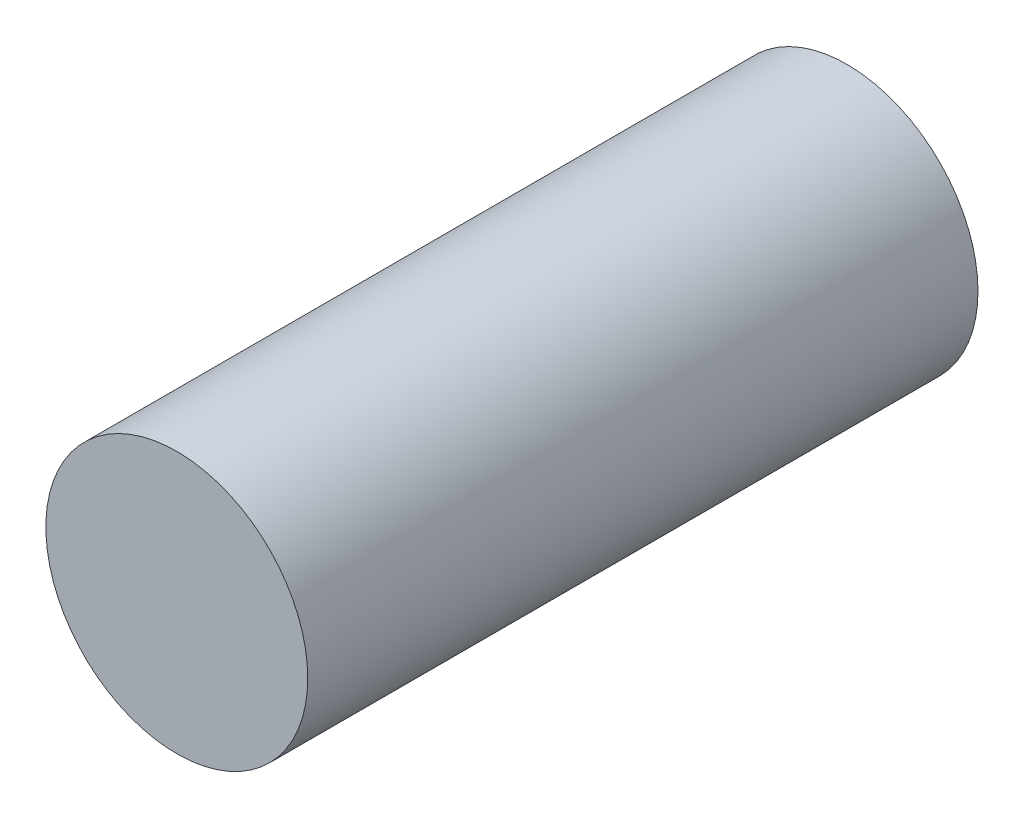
ISO-10303-21;
HEADER;
FILE_DESCRIPTION(('STEP AP214'),'2;1');
FILE_NAME('part.step','',(''),(''),'','','');
FILE_SCHEMA(('AUTOMOTIVE_DESIGN { 1 0 10303 214 1 1 1 1 }'));
ENDSEC;
DATA;
#1=APPLICATION_CONTEXT('core data for automotive mechanical design processes');
#2=APPLICATION_PROTOCOL_DEFINITION('international standard','automotive_design',2000,#1);
#3=PRODUCT_CONTEXT('',#1,'mechanical');
#4=PRODUCT('Part','Part','',(#3));
#5=PRODUCT_RELATED_PRODUCT_CATEGORY('part','',(#4));
#6=PRODUCT_DEFINITION_FORMATION('','',#4);
#7=PRODUCT_DEFINITION_CONTEXT('part definition',#1,'design');
#8=PRODUCT_DEFINITION('design','',#6,#7);
#9=PRODUCT_DEFINITION_SHAPE('','',#8);
#10=(LENGTH_UNIT() NAMED_UNIT(*) SI_UNIT(.MILLI.,.METRE.));
#11=(NAMED_UNIT(*) PLANE_ANGLE_UNIT() SI_UNIT($,.RADIAN.));
#12=(NAMED_UNIT(*) SI_UNIT($,.STERADIAN.) SOLID_ANGLE_UNIT());
#13=UNCERTAINTY_MEASURE_WITH_UNIT(LENGTH_MEASURE(1.E-05),#10,'distance_accuracy_value','');
#14=(GEOMETRIC_REPRESENTATION_CONTEXT(3) GLOBAL_UNCERTAINTY_ASSIGNED_CONTEXT((#13)) GLOBAL_UNIT_ASSIGNED_CONTEXT((#10,
#11,#12)) REPRESENTATION_CONTEXT('',''));
#15=CARTESIAN_POINT('',(0.,0.,0.));
#16=DIRECTION('',(0.,0.,1.));
#17=DIRECTION('',(1.,0.,0.));
#18=AXIS2_PLACEMENT_3D('',#15,#16,#17);
#19=CARTESIAN_POINT('',(0.,0.,65.));
#20=DIRECTION('',(0.,0.,-1.));
#21=DIRECTION('',(-1.,0.,0.));
#22=AXIS2_PLACEMENT_3D('',#19,#20,#21);
#23=CYLINDRICAL_SURFACE('',#22,12.7);
#24=CARTESIAN_POINT('',(0.,0.,65.));
#25=DIRECTION('',(0.,0.,1.));
#26=DIRECTION('',(1.,0.,0.));
#27=AXIS2_PLACEMENT_3D('',#24,#25,#26);
#28=CIRCLE('',#27,12.7);
#29=CARTESIAN_POINT('',(12.7,0.,65.));
#30=VERTEX_POINT('',#29);
#31=EDGE_CURVE('E10',#30,#30,#28,.T.);
#32=ORIENTED_EDGE('',*,*,#31,.F.);
#33=EDGE_LOOP('',(#32));
#34=FACE_BOUND('',#33,.T.);
#35=CARTESIAN_POINT('',(0.,0.,0.));
#36=DIRECTION('',(0.,0.,1.));
#37=DIRECTION('',(1.,0.,0.));
#38=AXIS2_PLACEMENT_3D('',#35,#36,#37);
#39=CIRCLE('',#38,12.7);
#40=CARTESIAN_POINT('',(12.7,0.,0.));
#41=VERTEX_POINT('',#40);
#42=EDGE_CURVE('E34',#41,#41,#39,.T.);
#43=ORIENTED_EDGE('',*,*,#42,.T.);
#44=EDGE_LOOP('',(#43));
#45=FACE_BOUND('',#44,.T.);
#46=ADVANCED_FACE('F31',(#34,#45),#23,.T.);
#47=CARTESIAN_POINT('',(0.,0.,65.));
#48=DIRECTION('',(0.,0.,1.));
#49=DIRECTION('',(1.,0.,0.));
#50=AXIS2_PLACEMENT_3D('',#47,#48,#49);
#51=PLANE('',#50);
#52=ORIENTED_EDGE('',*,*,#31,.T.);
#53=EDGE_LOOP('',(#52));
#54=FACE_BOUND('',#53,.T.);
#55=ADVANCED_FACE('F46',(#54),#51,.T.);
#56=CARTESIAN_POINT('',(0.,0.,0.));
#57=DIRECTION('',(0.,0.,1.));
#58=DIRECTION('',(1.,0.,0.));
#59=AXIS2_PLACEMENT_3D('',#56,#57,#58);
#60=PLANE('',#59);
#61=ORIENTED_EDGE('',*,*,#42,.F.);
#62=EDGE_LOOP('',(#61));
#63=FACE_BOUND('',#62,.T.);
#64=ADVANCED_FACE('F44',(#63),#60,.F.);
#65=CLOSED_SHELL('',(#46,#55,#64));
#66=MANIFOLD_SOLID_BREP('B2',#65);
#67=ADVANCED_BREP_SHAPE_REPRESENTATION('',(#18,#66),#14);
#68=SHAPE_DEFINITION_REPRESENTATION(#9,#67);
ENDSEC;
END-ISO-10303-21;
